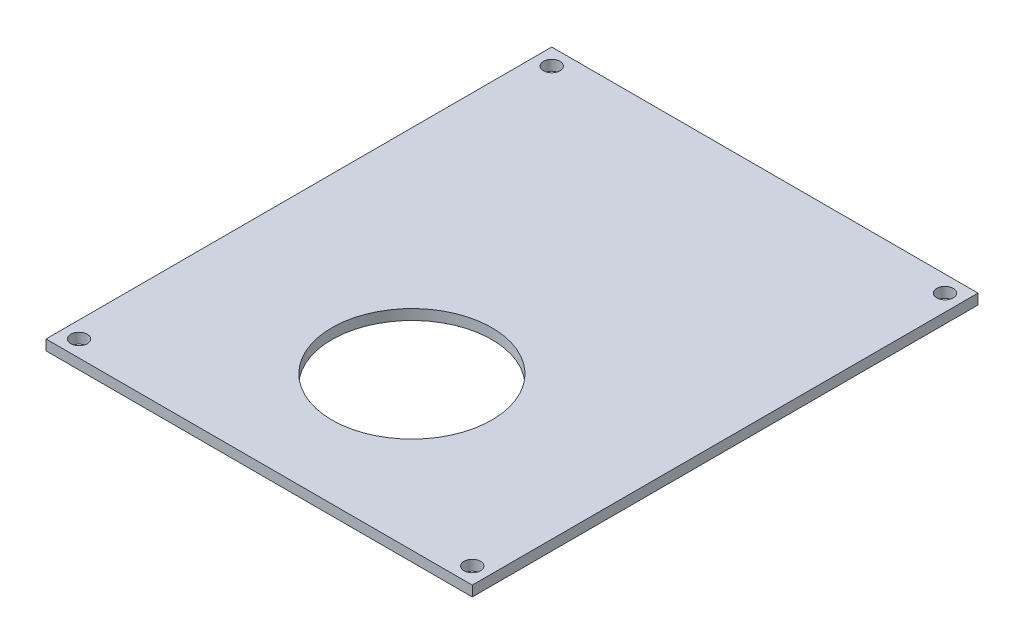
ISO-10303-21;
HEADER;
FILE_DESCRIPTION(('STEP AP214'),'2;1');
FILE_NAME('part.step','',(''),(''),'','','');
FILE_SCHEMA(('AUTOMOTIVE_DESIGN { 1 0 10303 214 1 1 1 1 }'));
ENDSEC;
DATA;
#1=APPLICATION_CONTEXT('core data for automotive mechanical design processes');
#2=APPLICATION_PROTOCOL_DEFINITION('international standard','automotive_design',2000,#1);
#3=PRODUCT_CONTEXT('',#1,'mechanical');
#4=PRODUCT('Part','Part','',(#3));
#5=PRODUCT_RELATED_PRODUCT_CATEGORY('part','',(#4));
#6=PRODUCT_DEFINITION_FORMATION('','',#4);
#7=PRODUCT_DEFINITION_CONTEXT('part definition',#1,'design');
#8=PRODUCT_DEFINITION('design','',#6,#7);
#9=PRODUCT_DEFINITION_SHAPE('','',#8);
#10=(LENGTH_UNIT() NAMED_UNIT(*) SI_UNIT(.MILLI.,.METRE.));
#11=(NAMED_UNIT(*) PLANE_ANGLE_UNIT() SI_UNIT($,.RADIAN.));
#12=(NAMED_UNIT(*) SI_UNIT($,.STERADIAN.) SOLID_ANGLE_UNIT());
#13=UNCERTAINTY_MEASURE_WITH_UNIT(LENGTH_MEASURE(1.E-05),#10,'distance_accuracy_value','');
#14=(GEOMETRIC_REPRESENTATION_CONTEXT(3) GLOBAL_UNCERTAINTY_ASSIGNED_CONTEXT((#13)) GLOBAL_UNIT_ASSIGNED_CONTEXT((#10,
#11,#12)) REPRESENTATION_CONTEXT('',''));
#15=CARTESIAN_POINT('',(0.,0.,0.));
#16=DIRECTION('',(0.,0.,1.));
#17=DIRECTION('',(1.,0.,0.));
#18=AXIS2_PLACEMENT_3D('',#15,#16,#17);
#19=CARTESIAN_POINT('',(-41.3,2.,-49.));
#20=DIRECTION('',(1.,0.,0.));
#21=DIRECTION('',(0.,0.,-1.));
#22=AXIS2_PLACEMENT_3D('',#19,#20,#21);
#23=PLANE('',#22);
#24=DIRECTION('',(0.,0.,1.));
#25=VECTOR('',#24,1.);
#26=CARTESIAN_POINT('',(-41.3,0.,-49.));
#27=LINE('',#26,#25);
#28=CARTESIAN_POINT('',(-41.3,0.,-49.));
#29=VERTEX_POINT('',#28);
#30=CARTESIAN_POINT('',(-41.3,0.,49.));
#31=VERTEX_POINT('',#30);
#32=EDGE_CURVE('E95',#29,#31,#27,.T.);
#33=ORIENTED_EDGE('',*,*,#32,.T.);
#34=DIRECTION('',(0.,-1.,0.));
#35=VECTOR('',#34,1.);
#36=CARTESIAN_POINT('',(-41.3,2.,49.));
#37=LINE('',#36,#35);
#38=CARTESIAN_POINT('',(-41.3,2.,49.));
#39=VERTEX_POINT('',#38);
#40=EDGE_CURVE('E11',#39,#31,#37,.T.);
#41=ORIENTED_EDGE('',*,*,#40,.F.);
#42=DIRECTION('',(0.,0.,1.));
#43=VECTOR('',#42,1.);
#44=CARTESIAN_POINT('',(-41.3,2.,-49.));
#45=LINE('',#44,#43);
#46=CARTESIAN_POINT('',(-41.3,2.,-49.));
#47=VERTEX_POINT('',#46);
#48=EDGE_CURVE('E83',#47,#39,#45,.T.);
#49=ORIENTED_EDGE('',*,*,#48,.F.);
#50=DIRECTION('',(0.,-1.,0.));
#51=VECTOR('',#50,1.);
#52=CARTESIAN_POINT('',(-41.3,2.,-49.));
#53=LINE('',#52,#51);
#54=EDGE_CURVE('E91',#47,#29,#53,.T.);
#55=ORIENTED_EDGE('',*,*,#54,.T.);
#56=EDGE_LOOP('',(#33,#41,#49,#55));
#57=FACE_BOUND('',#56,.T.);
#58=ADVANCED_FACE('F32',(#57),#23,.F.);
#59=CARTESIAN_POINT('',(41.3,2.,49.));
#60=DIRECTION('',(0.,0.,-1.));
#61=DIRECTION('',(-1.,0.,0.));
#62=AXIS2_PLACEMENT_3D('',#59,#60,#61);
#63=PLANE('',#62);
#64=DIRECTION('',(1.,0.,0.));
#65=VECTOR('',#64,1.);
#66=CARTESIAN_POINT('',(41.3,0.,49.));
#67=LINE('',#66,#65);
#68=CARTESIAN_POINT('',(41.3,0.,49.));
#69=VERTEX_POINT('',#68);
#70=EDGE_CURVE('E87',#31,#69,#67,.T.);
#71=ORIENTED_EDGE('',*,*,#70,.T.);
#72=DIRECTION('',(0.,-1.,0.));
#73=VECTOR('',#72,1.);
#74=CARTESIAN_POINT('',(41.3,2.,49.));
#75=LINE('',#74,#73);
#76=CARTESIAN_POINT('',(41.3,2.,49.));
#77=VERTEX_POINT('',#76);
#78=EDGE_CURVE('E40',#77,#69,#75,.T.);
#79=ORIENTED_EDGE('',*,*,#78,.F.);
#80=DIRECTION('',(1.,0.,0.));
#81=VECTOR('',#80,1.);
#82=CARTESIAN_POINT('',(41.3,2.,49.));
#83=LINE('',#82,#81);
#84=EDGE_CURVE('E78',#39,#77,#83,.T.);
#85=ORIENTED_EDGE('',*,*,#84,.F.);
#86=ORIENTED_EDGE('',*,*,#40,.T.);
#87=EDGE_LOOP('',(#71,#79,#85,#86));
#88=FACE_BOUND('',#87,.T.);
#89=ADVANCED_FACE('F86',(#88),#63,.F.);
#90=CARTESIAN_POINT('',(41.3,2.,-49.));
#91=DIRECTION('',(-1.,0.,0.));
#92=DIRECTION('',(0.,0.,1.));
#93=AXIS2_PLACEMENT_3D('',#90,#91,#92);
#94=PLANE('',#93);
#95=DIRECTION('',(0.,0.,-1.));
#96=VECTOR('',#95,1.);
#97=CARTESIAN_POINT('',(41.3,0.,-49.));
#98=LINE('',#97,#96);
#99=CARTESIAN_POINT('',(41.3,0.,-49.));
#100=VERTEX_POINT('',#99);
#101=EDGE_CURVE('E65',#69,#100,#98,.T.);
#102=ORIENTED_EDGE('',*,*,#101,.T.);
#103=DIRECTION('',(0.,-1.,0.));
#104=VECTOR('',#103,1.);
#105=CARTESIAN_POINT('',(41.3,2.,-49.));
#106=LINE('',#105,#104);
#107=CARTESIAN_POINT('',(41.3,2.,-49.));
#108=VERTEX_POINT('',#107);
#109=EDGE_CURVE('E88',#108,#100,#106,.T.);
#110=ORIENTED_EDGE('',*,*,#109,.F.);
#111=DIRECTION('',(0.,0.,-1.));
#112=VECTOR('',#111,1.);
#113=CARTESIAN_POINT('',(41.3,2.,-49.));
#114=LINE('',#113,#112);
#115=EDGE_CURVE('E81',#77,#108,#114,.T.);
#116=ORIENTED_EDGE('',*,*,#115,.F.);
#117=ORIENTED_EDGE('',*,*,#78,.T.);
#118=EDGE_LOOP('',(#102,#110,#116,#117));
#119=FACE_BOUND('',#118,.T.);
#120=ADVANCED_FACE('F89',(#119),#94,.F.);
#121=CARTESIAN_POINT('',(41.3,2.,-49.));
#122=DIRECTION('',(0.,0.,1.));
#123=DIRECTION('',(1.,0.,0.));
#124=AXIS2_PLACEMENT_3D('',#121,#122,#123);
#125=PLANE('',#124);
#126=DIRECTION('',(-1.,0.,0.));
#127=VECTOR('',#126,1.);
#128=CARTESIAN_POINT('',(41.3,0.,-49.));
#129=LINE('',#128,#127);
#130=EDGE_CURVE('E71',#100,#29,#129,.T.);
#131=ORIENTED_EDGE('',*,*,#130,.T.);
#132=ORIENTED_EDGE('',*,*,#54,.F.);
#133=DIRECTION('',(-1.,0.,0.));
#134=VECTOR('',#133,1.);
#135=CARTESIAN_POINT('',(41.3,2.,-49.));
#136=LINE('',#135,#134);
#137=EDGE_CURVE('E48',#108,#47,#136,.T.);
#138=ORIENTED_EDGE('',*,*,#137,.F.);
#139=ORIENTED_EDGE('',*,*,#109,.T.);
#140=EDGE_LOOP('',(#131,#132,#138,#139));
#141=FACE_BOUND('',#140,.T.);
#142=ADVANCED_FACE('F103',(#141),#125,.F.);
#143=CARTESIAN_POINT('',(0.,2.,0.));
#144=DIRECTION('',(0.,-1.,0.));
#145=DIRECTION('',(0.,0.,-1.));
#146=AXIS2_PLACEMENT_3D('',#143,#144,#145);
#147=PLANE('',#146);
#148=CARTESIAN_POINT('',(0.,2.,19.4));
#149=DIRECTION('',(0.,1.,0.));
#150=DIRECTION('',(0.,0.,1.));
#151=AXIS2_PLACEMENT_3D('',#148,#149,#150);
#152=CIRCLE('',#151,15.5);
#153=CARTESIAN_POINT('',(0.,2.,34.9));
#154=VERTEX_POINT('',#153);
#155=EDGE_CURVE('E133',#154,#154,#152,.T.);
#156=ORIENTED_EDGE('',*,*,#155,.F.);
#157=EDGE_LOOP('',(#156));
#158=FACE_BOUND('',#157,.T.);
#159=CARTESIAN_POINT('',(-38.1,2.,-45.8));
#160=DIRECTION('',(0.,1.,0.));
#161=DIRECTION('',(0.,0.,1.));
#162=AXIS2_PLACEMENT_3D('',#159,#160,#161);
#163=CIRCLE('',#162,1.59999999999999);
#164=CARTESIAN_POINT('',(-38.1,2.,-44.2));
#165=VERTEX_POINT('',#164);
#166=EDGE_CURVE('E129',#165,#165,#163,.T.);
#167=ORIENTED_EDGE('',*,*,#166,.F.);
#168=EDGE_LOOP('',(#167));
#169=FACE_BOUND('',#168,.T.);
#170=CARTESIAN_POINT('',(38.1,2.,-45.8));
#171=DIRECTION('',(0.,1.,0.));
#172=DIRECTION('',(0.,0.,1.));
#173=AXIS2_PLACEMENT_3D('',#170,#171,#172);
#174=CIRCLE('',#173,1.59999999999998);
#175=CARTESIAN_POINT('',(38.1,2.,-44.2));
#176=VERTEX_POINT('',#175);
#177=EDGE_CURVE('E123',#176,#176,#174,.T.);
#178=ORIENTED_EDGE('',*,*,#177,.F.);
#179=EDGE_LOOP('',(#178));
#180=FACE_BOUND('',#179,.T.);
#181=CARTESIAN_POINT('',(38.1,2.,45.8));
#182=DIRECTION('',(0.,1.,0.));
#183=DIRECTION('',(0.,0.,1.));
#184=AXIS2_PLACEMENT_3D('',#181,#182,#183);
#185=CIRCLE('',#184,1.59999999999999);
#186=CARTESIAN_POINT('',(38.1,2.,47.4));
#187=VERTEX_POINT('',#186);
#188=EDGE_CURVE('E117',#187,#187,#185,.T.);
#189=ORIENTED_EDGE('',*,*,#188,.F.);
#190=EDGE_LOOP('',(#189));
#191=FACE_BOUND('',#190,.T.);
#192=CARTESIAN_POINT('',(-38.1,2.,45.8));
#193=DIRECTION('',(0.,1.,0.));
#194=DIRECTION('',(0.,0.,1.));
#195=AXIS2_PLACEMENT_3D('',#192,#193,#194);
#196=CIRCLE('',#195,1.59999999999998);
#197=CARTESIAN_POINT('',(-38.1,2.,47.4));
#198=VERTEX_POINT('',#197);
#199=EDGE_CURVE('E111',#198,#198,#196,.T.);
#200=ORIENTED_EDGE('',*,*,#199,.F.);
#201=EDGE_LOOP('',(#200));
#202=FACE_BOUND('',#201,.T.);
#203=ORIENTED_EDGE('',*,*,#48,.T.);
#204=ORIENTED_EDGE('',*,*,#84,.T.);
#205=ORIENTED_EDGE('',*,*,#115,.T.);
#206=ORIENTED_EDGE('',*,*,#137,.T.);
#207=EDGE_LOOP('',(#203,#204,#205,#206));
#208=FACE_BOUND('',#207,.T.);
#209=ADVANCED_FACE('F79',(#158,#169,#180,#191,#202,#208),#147,.F.);
#210=CARTESIAN_POINT('',(0.,0.,0.));
#211=DIRECTION('',(0.,-1.,0.));
#212=DIRECTION('',(0.,0.,-1.));
#213=AXIS2_PLACEMENT_3D('',#210,#211,#212);
#214=PLANE('',#213);
#215=CARTESIAN_POINT('',(0.,0.,19.4));
#216=DIRECTION('',(0.,1.,0.));
#217=DIRECTION('',(0.,0.,1.));
#218=AXIS2_PLACEMENT_3D('',#215,#216,#217);
#219=CIRCLE('',#218,15.5);
#220=CARTESIAN_POINT('',(0.,0.,34.9));
#221=VERTEX_POINT('',#220);
#222=EDGE_CURVE('E132',#221,#221,#219,.T.);
#223=ORIENTED_EDGE('',*,*,#222,.T.);
#224=EDGE_LOOP('',(#223));
#225=FACE_BOUND('',#224,.T.);
#226=CARTESIAN_POINT('',(-38.1,0.,-45.8));
#227=DIRECTION('',(0.,1.,0.));
#228=DIRECTION('',(0.,0.,1.));
#229=AXIS2_PLACEMENT_3D('',#226,#227,#228);
#230=CIRCLE('',#229,1.59999999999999);
#231=CARTESIAN_POINT('',(-38.1,0.,-44.2));
#232=VERTEX_POINT('',#231);
#233=EDGE_CURVE('E126',#232,#232,#230,.T.);
#234=ORIENTED_EDGE('',*,*,#233,.T.);
#235=EDGE_LOOP('',(#234));
#236=FACE_BOUND('',#235,.T.);
#237=CARTESIAN_POINT('',(38.1,0.,-45.8));
#238=DIRECTION('',(0.,1.,0.));
#239=DIRECTION('',(0.,0.,1.));
#240=AXIS2_PLACEMENT_3D('',#237,#238,#239);
#241=CIRCLE('',#240,1.59999999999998);
#242=CARTESIAN_POINT('',(38.1,0.,-44.2));
#243=VERTEX_POINT('',#242);
#244=EDGE_CURVE('E120',#243,#243,#241,.T.);
#245=ORIENTED_EDGE('',*,*,#244,.T.);
#246=EDGE_LOOP('',(#245));
#247=FACE_BOUND('',#246,.T.);
#248=CARTESIAN_POINT('',(38.1,0.,45.8));
#249=DIRECTION('',(0.,1.,0.));
#250=DIRECTION('',(0.,0.,1.));
#251=AXIS2_PLACEMENT_3D('',#248,#249,#250);
#252=CIRCLE('',#251,1.59999999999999);
#253=CARTESIAN_POINT('',(38.1,0.,47.4));
#254=VERTEX_POINT('',#253);
#255=EDGE_CURVE('E114',#254,#254,#252,.T.);
#256=ORIENTED_EDGE('',*,*,#255,.T.);
#257=EDGE_LOOP('',(#256));
#258=FACE_BOUND('',#257,.T.);
#259=CARTESIAN_POINT('',(-38.1,0.,45.8));
#260=DIRECTION('',(0.,1.,0.));
#261=DIRECTION('',(0.,0.,1.));
#262=AXIS2_PLACEMENT_3D('',#259,#260,#261);
#263=CIRCLE('',#262,1.59999999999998);
#264=CARTESIAN_POINT('',(-38.1,0.,47.4));
#265=VERTEX_POINT('',#264);
#266=EDGE_CURVE('E98',#265,#265,#263,.T.);
#267=ORIENTED_EDGE('',*,*,#266,.T.);
#268=EDGE_LOOP('',(#267));
#269=FACE_BOUND('',#268,.T.);
#270=ORIENTED_EDGE('',*,*,#32,.F.);
#271=ORIENTED_EDGE('',*,*,#130,.F.);
#272=ORIENTED_EDGE('',*,*,#101,.F.);
#273=ORIENTED_EDGE('',*,*,#70,.F.);
#274=EDGE_LOOP('',(#270,#271,#272,#273));
#275=FACE_BOUND('',#274,.T.);
#276=ADVANCED_FACE('F106',(#225,#236,#247,#258,#269,#275),#214,.T.);
#277=CARTESIAN_POINT('',(-38.1,2.,45.8));
#278=DIRECTION('',(0.,1.,0.));
#279=DIRECTION('',(0.,0.,1.));
#280=AXIS2_PLACEMENT_3D('',#277,#278,#279);
#281=CYLINDRICAL_SURFACE('',#280,1.59999999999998);
#282=ORIENTED_EDGE('',*,*,#266,.F.);
#283=EDGE_LOOP('',(#282));
#284=FACE_BOUND('',#283,.T.);
#285=ORIENTED_EDGE('',*,*,#199,.T.);
#286=EDGE_LOOP('',(#285));
#287=FACE_BOUND('',#286,.T.);
#288=ADVANCED_FACE('F159',(#284,#287),#281,.F.);
#289=CARTESIAN_POINT('',(38.1,2.,45.8));
#290=DIRECTION('',(0.,1.,0.));
#291=DIRECTION('',(0.,0.,1.));
#292=AXIS2_PLACEMENT_3D('',#289,#290,#291);
#293=CYLINDRICAL_SURFACE('',#292,1.59999999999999);
#294=ORIENTED_EDGE('',*,*,#255,.F.);
#295=EDGE_LOOP('',(#294));
#296=FACE_BOUND('',#295,.T.);
#297=ORIENTED_EDGE('',*,*,#188,.T.);
#298=EDGE_LOOP('',(#297));
#299=FACE_BOUND('',#298,.T.);
#300=ADVANCED_FACE('F161',(#296,#299),#293,.F.);
#301=CARTESIAN_POINT('',(38.1,2.,-45.8));
#302=DIRECTION('',(0.,1.,0.));
#303=DIRECTION('',(0.,0.,1.));
#304=AXIS2_PLACEMENT_3D('',#301,#302,#303);
#305=CYLINDRICAL_SURFACE('',#304,1.59999999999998);
#306=ORIENTED_EDGE('',*,*,#244,.F.);
#307=EDGE_LOOP('',(#306));
#308=FACE_BOUND('',#307,.T.);
#309=ORIENTED_EDGE('',*,*,#177,.T.);
#310=EDGE_LOOP('',(#309));
#311=FACE_BOUND('',#310,.T.);
#312=ADVANCED_FACE('F168',(#308,#311),#305,.F.);
#313=CARTESIAN_POINT('',(-38.1,2.,-45.8));
#314=DIRECTION('',(0.,1.,0.));
#315=DIRECTION('',(0.,0.,1.));
#316=AXIS2_PLACEMENT_3D('',#313,#314,#315);
#317=CYLINDRICAL_SURFACE('',#316,1.59999999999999);
#318=ORIENTED_EDGE('',*,*,#233,.F.);
#319=EDGE_LOOP('',(#318));
#320=FACE_BOUND('',#319,.T.);
#321=ORIENTED_EDGE('',*,*,#166,.T.);
#322=EDGE_LOOP('',(#321));
#323=FACE_BOUND('',#322,.T.);
#324=ADVANCED_FACE('F144',(#320,#323),#317,.F.);
#325=CARTESIAN_POINT('',(0.,0.,19.4));
#326=DIRECTION('',(0.,1.,0.));
#327=DIRECTION('',(0.,0.,1.));
#328=AXIS2_PLACEMENT_3D('',#325,#326,#327);
#329=CYLINDRICAL_SURFACE('',#328,15.5);
#330=ORIENTED_EDGE('',*,*,#222,.F.);
#331=EDGE_LOOP('',(#330));
#332=FACE_BOUND('',#331,.T.);
#333=ORIENTED_EDGE('',*,*,#155,.T.);
#334=EDGE_LOOP('',(#333));
#335=FACE_BOUND('',#334,.T.);
#336=ADVANCED_FACE('F141',(#332,#335),#329,.F.);
#337=CLOSED_SHELL('',(#58,#89,#120,#142,#209,#276,#288,#300,#312,#324,#336));
#338=MANIFOLD_SOLID_BREP('B2',#337);
#339=ADVANCED_BREP_SHAPE_REPRESENTATION('',(#18,#338),#14);
#340=SHAPE_DEFINITION_REPRESENTATION(#9,#339);
ENDSEC;
END-ISO-10303-21;
